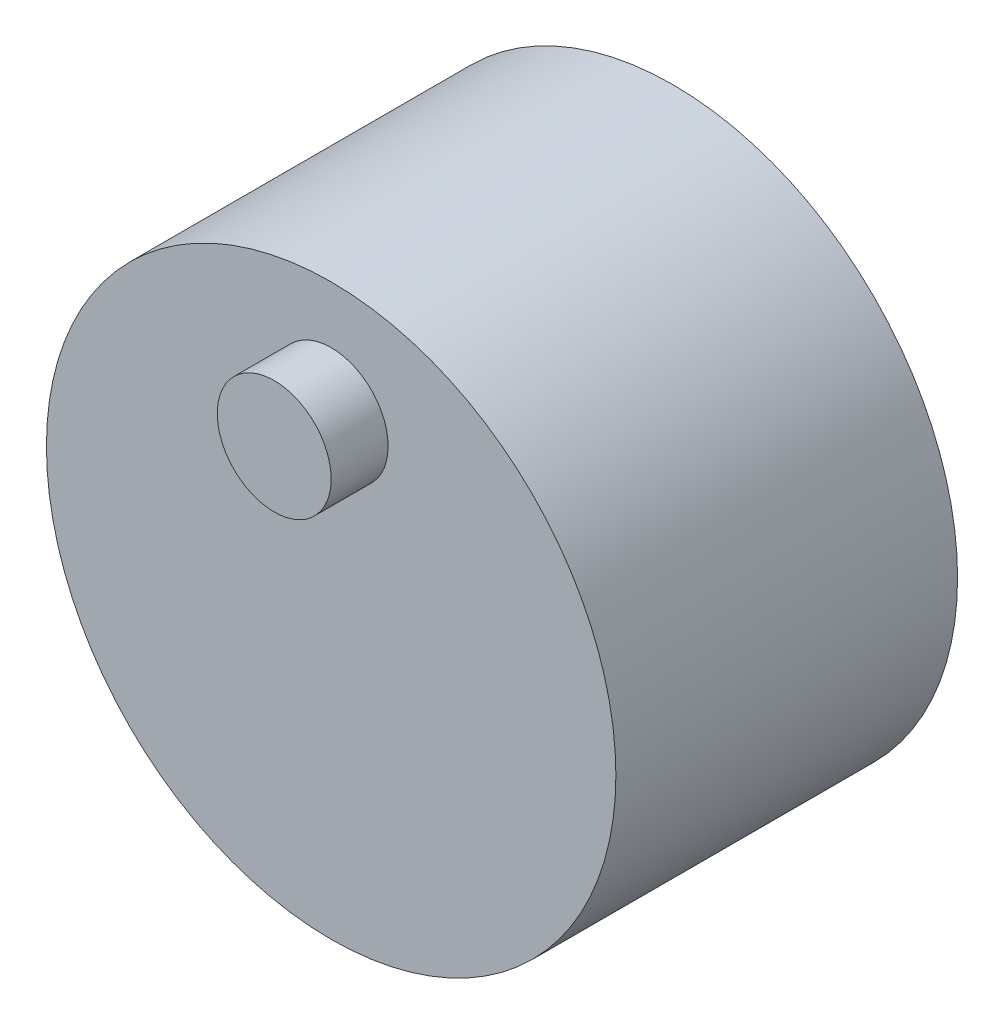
ISO-10303-21;
HEADER;
FILE_DESCRIPTION(('STEP AP214'),'2;1');
FILE_NAME('part.step','',(''),(''),'','','');
FILE_SCHEMA(('AUTOMOTIVE_DESIGN { 1 0 10303 214 1 1 1 1 }'));
ENDSEC;
DATA;
#1=APPLICATION_CONTEXT('core data for automotive mechanical design processes');
#2=APPLICATION_PROTOCOL_DEFINITION('international standard','automotive_design',2000,#1);
#3=PRODUCT_CONTEXT('',#1,'mechanical');
#4=PRODUCT('Part','Part','',(#3));
#5=PRODUCT_RELATED_PRODUCT_CATEGORY('part','',(#4));
#6=PRODUCT_DEFINITION_FORMATION('','',#4);
#7=PRODUCT_DEFINITION_CONTEXT('part definition',#1,'design');
#8=PRODUCT_DEFINITION('design','',#6,#7);
#9=PRODUCT_DEFINITION_SHAPE('','',#8);
#10=(LENGTH_UNIT() NAMED_UNIT(*) SI_UNIT(.MILLI.,.METRE.));
#11=(NAMED_UNIT(*) PLANE_ANGLE_UNIT() SI_UNIT($,.RADIAN.));
#12=(NAMED_UNIT(*) SI_UNIT($,.STERADIAN.) SOLID_ANGLE_UNIT());
#13=UNCERTAINTY_MEASURE_WITH_UNIT(LENGTH_MEASURE(1.E-05),#10,'distance_accuracy_value','');
#14=(GEOMETRIC_REPRESENTATION_CONTEXT(3) GLOBAL_UNCERTAINTY_ASSIGNED_CONTEXT((#13)) GLOBAL_UNIT_ASSIGNED_CONTEXT((#10,
#11,#12)) REPRESENTATION_CONTEXT('',''));
#15=CARTESIAN_POINT('',(0.,0.,0.));
#16=DIRECTION('',(0.,0.,1.));
#17=DIRECTION('',(1.,0.,0.));
#18=AXIS2_PLACEMENT_3D('',#15,#16,#17);
#19=CARTESIAN_POINT('',(0.,0.,-150.));
#20=DIRECTION('',(0.,0.,1.));
#21=DIRECTION('',(1.,0.,0.));
#22=AXIS2_PLACEMENT_3D('',#19,#20,#21);
#23=PLANE('',#22);
#24=CARTESIAN_POINT('',(0.,0.,-150.));
#25=DIRECTION('',(0.,0.,1.));
#26=DIRECTION('',(1.,0.,0.));
#27=AXIS2_PLACEMENT_3D('',#24,#25,#26);
#28=CIRCLE('',#27,250.);
#29=CARTESIAN_POINT('',(250.,0.,-150.));
#30=VERTEX_POINT('',#29);
#31=EDGE_CURVE('E38',#30,#30,#28,.T.);
#32=ORIENTED_EDGE('',*,*,#31,.F.);
#33=EDGE_LOOP('',(#32));
#34=FACE_BOUND('',#33,.T.);
#35=CARTESIAN_POINT('',(0.,-150.,-150.));
#36=DIRECTION('',(0.,0.,1.));
#37=DIRECTION('',(1.,0.,0.));
#38=AXIS2_PLACEMENT_3D('',#35,#36,#37);
#39=CIRCLE('',#38,50.);
#40=CARTESIAN_POINT('',(50.,-150.,-150.));
#41=VERTEX_POINT('',#40);
#42=EDGE_CURVE('E10',#41,#41,#39,.F.);
#43=ORIENTED_EDGE('',*,*,#42,.F.);
#44=EDGE_LOOP('',(#43));
#45=FACE_BOUND('',#44,.T.);
#46=ADVANCED_FACE('F31',(#34,#45),#23,.F.);
#47=CARTESIAN_POINT('',(0.,0.,150.));
#48=DIRECTION('',(0.,0.,1.));
#49=DIRECTION('',(1.,0.,0.));
#50=AXIS2_PLACEMENT_3D('',#47,#48,#49);
#51=PLANE('',#50);
#52=CARTESIAN_POINT('',(0.,0.,150.));
#53=DIRECTION('',(0.,0.,1.));
#54=DIRECTION('',(1.,0.,0.));
#55=AXIS2_PLACEMENT_3D('',#52,#53,#54);
#56=CIRCLE('',#55,250.);
#57=CARTESIAN_POINT('',(250.,0.,150.));
#58=VERTEX_POINT('',#57);
#59=EDGE_CURVE('E42',#58,#58,#56,.T.);
#60=ORIENTED_EDGE('',*,*,#59,.T.);
#61=EDGE_LOOP('',(#60));
#62=FACE_BOUND('',#61,.T.);
#63=CARTESIAN_POINT('',(0.,150.,150.));
#64=DIRECTION('',(0.,0.,1.));
#65=DIRECTION('',(1.,0.,0.));
#66=AXIS2_PLACEMENT_3D('',#63,#64,#65);
#67=CIRCLE('',#66,50.);
#68=CARTESIAN_POINT('',(50.,150.,150.));
#69=VERTEX_POINT('',#68);
#70=EDGE_CURVE('E51',#69,#69,#67,.T.);
#71=ORIENTED_EDGE('',*,*,#70,.F.);
#72=EDGE_LOOP('',(#71));
#73=FACE_BOUND('',#72,.T.);
#74=ADVANCED_FACE('F73',(#62,#73),#51,.T.);
#75=CARTESIAN_POINT('',(0.,0.,-150.));
#76=DIRECTION('',(0.,0.,1.));
#77=DIRECTION('',(1.,0.,0.));
#78=AXIS2_PLACEMENT_3D('',#75,#76,#77);
#79=CYLINDRICAL_SURFACE('',#78,250.);
#80=ORIENTED_EDGE('',*,*,#31,.T.);
#81=EDGE_LOOP('',(#80));
#82=FACE_BOUND('',#81,.T.);
#83=ORIENTED_EDGE('',*,*,#59,.F.);
#84=EDGE_LOOP('',(#83));
#85=FACE_BOUND('',#84,.T.);
#86=ADVANCED_FACE('F33',(#82,#85),#79,.T.);
#87=CARTESIAN_POINT('',(0.,150.,341.42135623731));
#88=DIRECTION('',(0.,0.,-1.));
#89=DIRECTION('',(-1.,0.,0.));
#90=AXIS2_PLACEMENT_3D('',#87,#88,#89);
#91=CYLINDRICAL_SURFACE('',#90,50.);
#92=ORIENTED_EDGE('',*,*,#70,.T.);
#93=EDGE_LOOP('',(#92));
#94=FACE_BOUND('',#93,.T.);
#95=CARTESIAN_POINT('',(0.,150.,200.));
#96=DIRECTION('',(0.,0.,1.));
#97=DIRECTION('',(1.,0.,0.));
#98=AXIS2_PLACEMENT_3D('',#95,#96,#97);
#99=CIRCLE('',#98,50.);
#100=CARTESIAN_POINT('',(50.,150.,200.));
#101=VERTEX_POINT('',#100);
#102=EDGE_CURVE('E46',#101,#101,#99,.T.);
#103=ORIENTED_EDGE('',*,*,#102,.F.);
#104=EDGE_LOOP('',(#103));
#105=FACE_BOUND('',#104,.T.);
#106=ADVANCED_FACE('F69',(#94,#105),#91,.T.);
#107=CARTESIAN_POINT('',(0.,0.,200.));
#108=DIRECTION('',(0.,0.,1.));
#109=DIRECTION('',(1.,0.,0.));
#110=AXIS2_PLACEMENT_3D('',#107,#108,#109);
#111=PLANE('',#110);
#112=ORIENTED_EDGE('',*,*,#102,.T.);
#113=EDGE_LOOP('',(#112));
#114=FACE_BOUND('',#113,.T.);
#115=ADVANCED_FACE('F62',(#114),#111,.T.);
#116=CARTESIAN_POINT('',(0.,-150.,-341.42135623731));
#117=DIRECTION('',(0.,0.,1.));
#118=DIRECTION('',(1.,0.,0.));
#119=AXIS2_PLACEMENT_3D('',#116,#117,#118);
#120=CYLINDRICAL_SURFACE('',#119,50.);
#121=ORIENTED_EDGE('',*,*,#42,.T.);
#122=EDGE_LOOP('',(#121));
#123=FACE_BOUND('',#122,.T.);
#124=CARTESIAN_POINT('',(0.,-150.,-200.));
#125=DIRECTION('',(0.,0.,-1.));
#126=DIRECTION('',(-1.,0.,0.));
#127=AXIS2_PLACEMENT_3D('',#124,#125,#126);
#128=CIRCLE('',#127,50.);
#129=CARTESIAN_POINT('',(-50.,-150.,-200.));
#130=VERTEX_POINT('',#129);
#131=EDGE_CURVE('E54',#130,#130,#128,.T.);
#132=ORIENTED_EDGE('',*,*,#131,.F.);
#133=EDGE_LOOP('',(#132));
#134=FACE_BOUND('',#133,.T.);
#135=ADVANCED_FACE('F60',(#123,#134),#120,.T.);
#136=CARTESIAN_POINT('',(0.,0.,-200.));
#137=DIRECTION('',(0.,0.,-1.));
#138=DIRECTION('',(-1.,0.,0.));
#139=AXIS2_PLACEMENT_3D('',#136,#137,#138);
#140=PLANE('',#139);
#141=ORIENTED_EDGE('',*,*,#131,.T.);
#142=EDGE_LOOP('',(#141));
#143=FACE_BOUND('',#142,.T.);
#144=ADVANCED_FACE('F58',(#143),#140,.T.);
#145=CLOSED_SHELL('',(#46,#74,#86,#106,#115,#135,#144));
#146=MANIFOLD_SOLID_BREP('B2',#145);
#147=ADVANCED_BREP_SHAPE_REPRESENTATION('',(#18,#146),#14);
#148=SHAPE_DEFINITION_REPRESENTATION(#9,#147);
ENDSEC;
END-ISO-10303-21;
